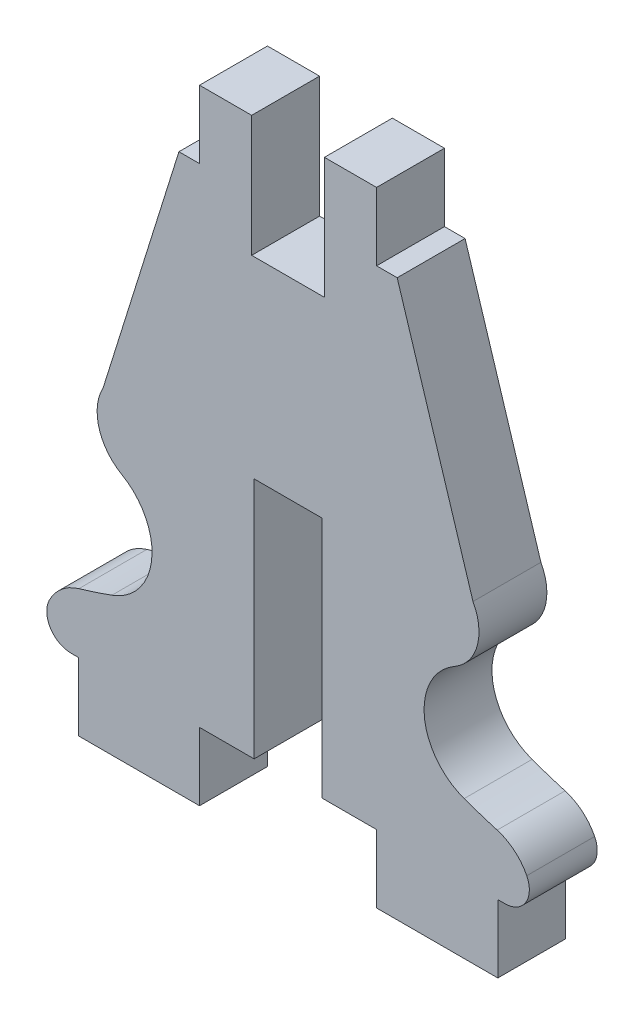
from build123d import *

# Parameters (mm, degrees)
BOSS_EXTRUDE1_DEPTH = 2.8


with BuildPart() as part:
    # Sketch1 → Boss-Extrude1 (new body)
    with BuildSketch(Plane.XY):
        with BuildLine():
            Line((-8.65, 0), (-8.95, 0))
            ThreePointArc((-8.95, 0), (-9.80142372, 0.475521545), (-9.843106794, 1.449844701))
            ThreePointArc((-9.843106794, 1.449844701), (-9.338399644, 2.085649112), (-8.62257182, 2.468489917))
            ThreePointArc((-8.62257182, 2.468489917), (-7.939265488, 2.680898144), (-7.262466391, 2.913207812))
            ThreePointArc((-7.262466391, 2.913207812), (-5.618148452, 5.047506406), (-6.866359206, 7.435179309))
            ThreePointArc((-6.866359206, 7.435179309), (-7.797543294, 8.628181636), (-7.626500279, 10.131877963))
            Line((-7.626500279, 10.131877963), (-4.5, 20.131877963))
            Line((-4.5, 20.131877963), (-3.65, 20.131877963))
            Line((-3.65, 20.131877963), (-3.65, 22.931877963))
            Line((-3.65, 22.931877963), (-1.5, 22.931877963))
            Line((-1.5, 22.931877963), (-1.5, 17.931877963))
            Line((-1.5, 17.931877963), (1.5, 17.931877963))
            Line((1.5, 17.931877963), (1.5, 22.931877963))
            Line((1.5, 22.931877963), (3.65, 22.931877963))
            Line((3.65, 22.931877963), (3.65, 20.131877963))
            Line((3.65, 20.131877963), (4.5, 20.131877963))
            Line((4.5, 20.131877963), (7.626500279, 10.131877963))
            ThreePointArc((7.626500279, 10.131877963), (7.797543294, 8.628181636), (6.866359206, 7.435179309))
            ThreePointArc((6.866359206, 7.435179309), (5.618148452, 5.047506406), (7.262466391, 2.913207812))
            ThreePointArc((7.262466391, 2.913207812), (7.939265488, 2.680898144), (8.62257182, 2.468489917))
            ThreePointArc((8.62257182, 2.468489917), (9.338399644, 2.085649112), (9.843106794, 1.449844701))
            ThreePointArc((9.843106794, 1.449844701), (9.80142372, 0.475521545), (8.95, 0))
            Line((8.95, 0), (8.65, 0))
            Line((8.65, 0), (8.65, -2.8))
            Line((8.65, -2.8), (3.65, -2.8))
            Line((3.65, -2.8), (3.65, 0))
            Line((3.65, 0), (1.4, 0))
            Line((1.4, 0), (1.4, 10))
            Line((1.4, 10), (-1.4, 10))
            Line((-1.4, 10), (-1.4, 0))
            Line((-1.4, 0), (-3.65, 0))
            Line((-3.65, 0), (-3.65, -2.8))
            Line((-3.65, -2.8), (-8.65, -2.8))
            Line((-8.65, -2.8), (-8.65, 0))
        make_face()
    extrude(amount=BOSS_EXTRUDE1_DEPTH)


solid = part.part
